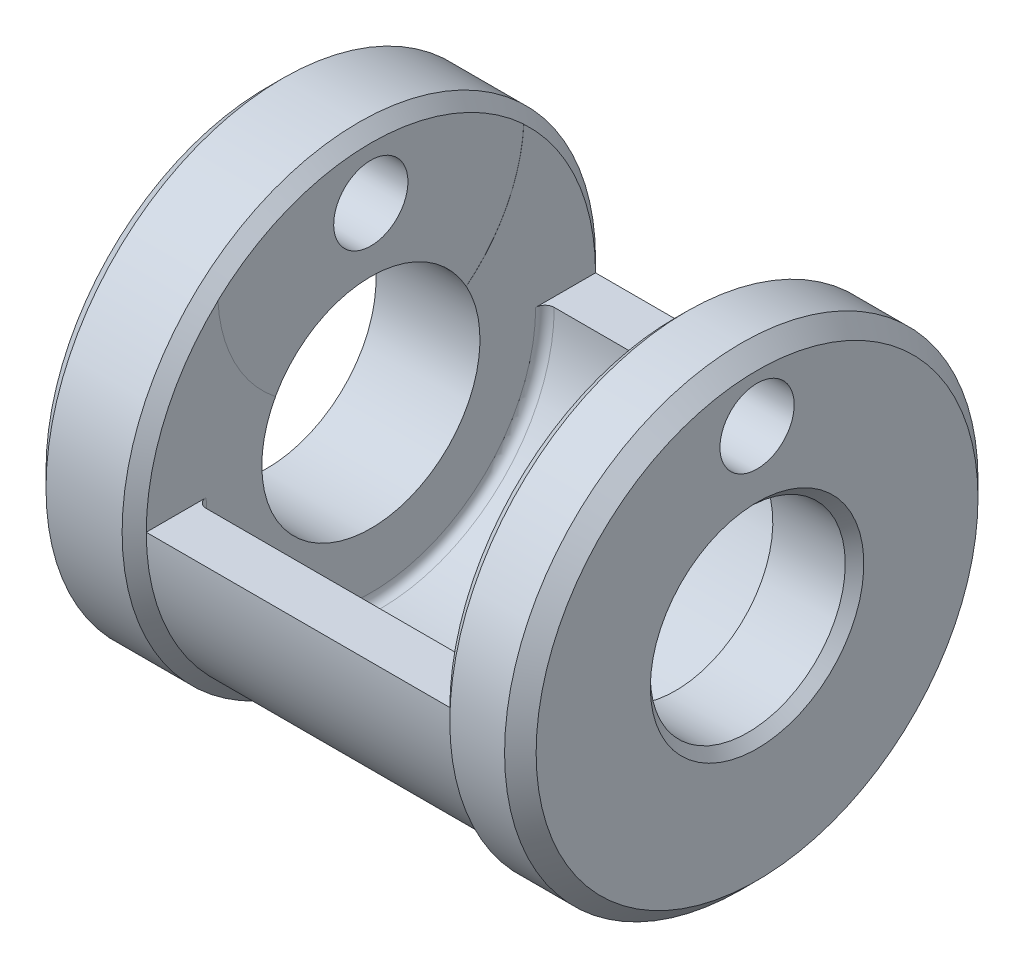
ISO-10303-21;
HEADER;
FILE_DESCRIPTION(('STEP AP214'),'2;1');
FILE_NAME('part.step','',(''),(''),'','','');
FILE_SCHEMA(('AUTOMOTIVE_DESIGN { 1 0 10303 214 1 1 1 1 }'));
ENDSEC;
DATA;
#1=APPLICATION_CONTEXT('core data for automotive mechanical design processes');
#2=APPLICATION_PROTOCOL_DEFINITION('international standard','automotive_design',2000,#1);
#3=PRODUCT_CONTEXT('',#1,'mechanical');
#4=PRODUCT('Part','Part','',(#3));
#5=PRODUCT_RELATED_PRODUCT_CATEGORY('part','',(#4));
#6=PRODUCT_DEFINITION_FORMATION('','',#4);
#7=PRODUCT_DEFINITION_CONTEXT('part definition',#1,'design');
#8=PRODUCT_DEFINITION('design','',#6,#7);
#9=PRODUCT_DEFINITION_SHAPE('','',#8);
#10=(LENGTH_UNIT() NAMED_UNIT(*) SI_UNIT(.MILLI.,.METRE.));
#11=(NAMED_UNIT(*) PLANE_ANGLE_UNIT() SI_UNIT($,.RADIAN.));
#12=(NAMED_UNIT(*) SI_UNIT($,.STERADIAN.) SOLID_ANGLE_UNIT());
#13=UNCERTAINTY_MEASURE_WITH_UNIT(LENGTH_MEASURE(1.E-05),#10,'distance_accuracy_value','');
#14=(GEOMETRIC_REPRESENTATION_CONTEXT(3) GLOBAL_UNCERTAINTY_ASSIGNED_CONTEXT((#13)) GLOBAL_UNIT_ASSIGNED_CONTEXT((#10,
#11,#12)) REPRESENTATION_CONTEXT('',''));
#15=CARTESIAN_POINT('',(0.,0.,0.));
#16=DIRECTION('',(0.,0.,1.));
#17=DIRECTION('',(1.,0.,0.));
#18=AXIS2_PLACEMENT_3D('',#15,#16,#17);
#19=CARTESIAN_POINT('',(-27.2,18.6,0.));
#20=DIRECTION('',(1.,0.,0.));
#21=DIRECTION('',(0.,0.,-1.));
#22=AXIS2_PLACEMENT_3D('',#19,#20,#21);
#23=CYLINDRICAL_SURFACE('',#22,4.);
#24=CARTESIAN_POINT('',(-25.,18.6,0.));
#25=DIRECTION('',(1.,0.,0.));
#26=DIRECTION('',(0.,0.,-1.));
#27=AXIS2_PLACEMENT_3D('',#24,#25,#26);
#28=CIRCLE('',#27,4.);
#29=CARTESIAN_POINT('',(-25.,18.6,-4.));
#30=VERTEX_POINT('',#29);
#31=EDGE_CURVE('E522',#30,#30,#28,.T.);
#32=ORIENTED_EDGE('',*,*,#31,.F.);
#33=EDGE_LOOP('',(#32));
#34=FACE_BOUND('',#33,.T.);
#35=CARTESIAN_POINT('',(-13.81,18.6,0.));
#36=DIRECTION('',(1.,0.,0.));
#37=DIRECTION('',(0.,1.,0.));
#38=AXIS2_PLACEMENT_3D('',#35,#36,#37);
#39=CIRCLE('',#38,4.);
#40=CARTESIAN_POINT('',(-13.81,22.6,0.));
#41=VERTEX_POINT('',#40);
#42=EDGE_CURVE('E680',#41,#41,#39,.F.);
#43=ORIENTED_EDGE('',*,*,#42,.F.);
#44=EDGE_LOOP('',(#43));
#45=FACE_BOUND('',#44,.T.);
#46=ADVANCED_FACE('F358',(#34,#45),#23,.F.);
#47=CARTESIAN_POINT('',(27.8,18.6000000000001,0.));
#48=DIRECTION('',(1.,0.,0.));
#49=DIRECTION('',(0.,0.,-1.));
#50=AXIS2_PLACEMENT_3D('',#47,#48,#49);
#51=CIRCLE('',#50,4.);
#52=CARTESIAN_POINT('',(27.8,18.6000000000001,-4.));
#53=VERTEX_POINT('',#52);
#54=EDGE_CURVE('E525',#53,#53,#51,.T.);
#55=ORIENTED_EDGE('',*,*,#54,.T.);
#56=EDGE_LOOP('',(#55));
#57=FACE_BOUND('',#56,.T.);
#58=CARTESIAN_POINT('',(19.01,18.6,0.));
#59=DIRECTION('',(-1.,0.,0.));
#60=DIRECTION('',(0.,0.,1.));
#61=AXIS2_PLACEMENT_3D('',#58,#59,#60);
#62=CIRCLE('',#61,4.);
#63=CARTESIAN_POINT('',(19.01,18.6,4.));
#64=VERTEX_POINT('',#63);
#65=EDGE_CURVE('E666',#64,#64,#62,.F.);
#66=ORIENTED_EDGE('',*,*,#65,.F.);
#67=EDGE_LOOP('',(#66));
#68=FACE_BOUND('',#67,.T.);
#69=ADVANCED_FACE('F579',(#57,#68),#23,.F.);
#70=CARTESIAN_POINT('',(-130.,0.,0.));
#71=DIRECTION('',(-1.,0.,0.));
#72=DIRECTION('',(0.,0.,1.));
#73=AXIS2_PLACEMENT_3D('',#70,#71,#72);
#74=CYLINDRICAL_SURFACE('',#73,10.5);
#75=CARTESIAN_POINT('',(26.8,0.,0.));
#76=DIRECTION('',(-1.,0.,0.));
#77=DIRECTION('',(0.,0.,1.));
#78=AXIS2_PLACEMENT_3D('',#75,#76,#77);
#79=CIRCLE('',#78,10.5);
#80=CARTESIAN_POINT('',(26.8,0.,10.5));
#81=VERTEX_POINT('',#80);
#82=EDGE_CURVE('E662',#81,#81,#79,.F.);
#83=ORIENTED_EDGE('',*,*,#82,.T.);
#84=EDGE_LOOP('',(#83));
#85=FACE_BOUND('',#84,.T.);
#86=CARTESIAN_POINT('',(19.01,0.,0.));
#87=DIRECTION('',(-1.,0.,0.));
#88=DIRECTION('',(0.,0.,1.));
#89=AXIS2_PLACEMENT_3D('',#86,#87,#88);
#90=CIRCLE('',#89,10.5);
#91=CARTESIAN_POINT('',(19.01,9.93003652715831,-3.41238546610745));
#92=VERTEX_POINT('',#91);
#93=CARTESIAN_POINT('',(19.01,9.93003652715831,3.41238546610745));
#94=VERTEX_POINT('',#93);
#95=EDGE_CURVE('E786',#92,#94,#90,.F.);
#96=ORIENTED_EDGE('',*,*,#95,.F.);
#97=DIRECTION('',(-1.,0.,0.));
#98=VECTOR('',#97,1.);
#99=CARTESIAN_POINT('',(19.005,9.9300365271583,-3.41238546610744));
#100=LINE('',#99,#98);
#101=CARTESIAN_POINT('',(19.,9.9300365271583,-3.41238546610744));
#102=VERTEX_POINT('',#101);
#103=EDGE_CURVE('E532',#92,#102,#100,.T.);
#104=ORIENTED_EDGE('',*,*,#103,.T.);
#105=CARTESIAN_POINT('',(19.,0.,0.));
#106=DIRECTION('',(1.,0.,0.));
#107=DIRECTION('',(0.,0.,-1.));
#108=AXIS2_PLACEMENT_3D('',#105,#106,#107);
#109=CIRCLE('',#108,10.5);
#110=CARTESIAN_POINT('',(19.,9.9300365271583,3.41238546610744));
#111=VERTEX_POINT('',#110);
#112=EDGE_CURVE('E501',#102,#111,#109,.F.);
#113=ORIENTED_EDGE('',*,*,#112,.T.);
#114=DIRECTION('',(-1.,0.,0.));
#115=VECTOR('',#114,1.);
#116=CARTESIAN_POINT('',(19.005,9.9300365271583,3.41238546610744));
#117=LINE('',#116,#115);
#118=EDGE_CURVE('E534',#111,#94,#117,.F.);
#119=ORIENTED_EDGE('',*,*,#118,.T.);
#120=EDGE_LOOP('',(#96,#104,#113,#119));
#121=FACE_BOUND('',#120,.T.);
#122=ADVANCED_FACE('F360',(#85,#121),#74,.F.);
#123=CARTESIAN_POINT('',(-13.8,0.,-27.5));
#124=DIRECTION('',(0.,-1.,0.));
#125=DIRECTION('',(0.,0.,-1.));
#126=AXIS2_PLACEMENT_3D('',#123,#124,#125);
#127=PLANE('',#126);
#128=DIRECTION('',(-1.,0.,0.));
#129=VECTOR('',#128,1.);
#130=CARTESIAN_POINT('',(-31.8084188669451,0.,18.75));
#131=LINE('',#130,#129);
#132=CARTESIAN_POINT('',(-12.8,0.,18.75));
#133=VERTEX_POINT('',#132);
#134=CARTESIAN_POINT('',(18.,0.,18.75));
#135=VERTEX_POINT('',#134);
#136=EDGE_CURVE('E517',#133,#135,#131,.F.);
#137=ORIENTED_EDGE('',*,*,#136,.F.);
#138=CARTESIAN_POINT('',(-12.8,0.,17.75));
#139=DIRECTION('',(0.,-1.,0.));
#140=DIRECTION('',(0.,0.,-1.));
#141=AXIS2_PLACEMENT_3D('',#138,#139,#140);
#142=CIRCLE('',#141,1.);
#143=CARTESIAN_POINT('',(-13.8,0.,17.75));
#144=VERTEX_POINT('',#143);
#145=EDGE_CURVE('E649',#133,#144,#142,.T.);
#146=ORIENTED_EDGE('',*,*,#145,.T.);
#147=DIRECTION('',(0.,0.,1.));
#148=VECTOR('',#147,1.);
#149=CARTESIAN_POINT('',(-13.8,0.,-27.5));
#150=LINE('',#149,#148);
#151=CARTESIAN_POINT('',(-13.8,0.,24.2000000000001));
#152=VERTEX_POINT('',#151);
#153=EDGE_CURVE('E514',#144,#152,#150,.T.);
#154=ORIENTED_EDGE('',*,*,#153,.T.);
#155=DIRECTION('',(-1.,0.,0.));
#156=VECTOR('',#155,1.);
#157=CARTESIAN_POINT('',(-130.,0.,24.2000000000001));
#158=LINE('',#157,#156);
#159=CARTESIAN_POINT('',(18.9,0.,24.2000000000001));
#160=VERTEX_POINT('',#159);
#161=EDGE_CURVE('E509',#160,#152,#158,.T.);
#162=ORIENTED_EDGE('',*,*,#161,.F.);
#163=DIRECTION('',(-0.707106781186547,0.,-0.707106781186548));
#164=VECTOR('',#163,1.);
#165=CARTESIAN_POINT('',(-5.29999999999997,0.,0.));
#166=LINE('',#165,#164);
#167=CARTESIAN_POINT('',(19.,0.,24.3));
#168=VERTEX_POINT('',#167);
#169=EDGE_CURVE('E626',#160,#168,#166,.F.);
#170=ORIENTED_EDGE('',*,*,#169,.T.);
#171=DIRECTION('',(0.,0.,1.));
#172=VECTOR('',#171,1.);
#173=CARTESIAN_POINT('',(19.,0.,-27.5));
#174=LINE('',#173,#172);
#175=CARTESIAN_POINT('',(19.,0.,17.75));
#176=VERTEX_POINT('',#175);
#177=EDGE_CURVE('E518',#176,#168,#174,.T.);
#178=ORIENTED_EDGE('',*,*,#177,.F.);
#179=CARTESIAN_POINT('',(18.,0.,17.75));
#180=DIRECTION('',(0.,-1.,0.));
#181=DIRECTION('',(0.,0.,-1.));
#182=AXIS2_PLACEMENT_3D('',#179,#180,#181);
#183=CIRCLE('',#182,1.);
#184=EDGE_CURVE('E654',#176,#135,#183,.T.);
#185=ORIENTED_EDGE('',*,*,#184,.T.);
#186=EDGE_LOOP('',(#137,#146,#154,#162,#170,#178,#185));
#187=FACE_BOUND('',#186,.T.);
#188=ADVANCED_FACE('F588',(#187),#127,.F.);
#189=DIRECTION('',(-1.,0.,0.));
#190=VECTOR('',#189,1.);
#191=CARTESIAN_POINT('',(-31.8084188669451,0.,-18.7499999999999));
#192=LINE('',#191,#190);
#193=CARTESIAN_POINT('',(18.,0.,-18.7499999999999));
#194=VERTEX_POINT('',#193);
#195=CARTESIAN_POINT('',(-12.8,0.,-18.7499999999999));
#196=VERTEX_POINT('',#195);
#197=EDGE_CURVE('E635',#194,#196,#192,.T.);
#198=ORIENTED_EDGE('',*,*,#197,.F.);
#199=CARTESIAN_POINT('',(18.,0.,-17.7499999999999));
#200=DIRECTION('',(0.,-1.,0.));
#201=DIRECTION('',(0.,0.,-1.));
#202=AXIS2_PLACEMENT_3D('',#199,#200,#201);
#203=CIRCLE('',#202,1.);
#204=CARTESIAN_POINT('',(19.,0.,-17.7499999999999));
#205=VERTEX_POINT('',#204);
#206=EDGE_CURVE('E656',#194,#205,#203,.T.);
#207=ORIENTED_EDGE('',*,*,#206,.T.);
#208=CARTESIAN_POINT('',(19.,0.,-24.2999999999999));
#209=VERTEX_POINT('',#208);
#210=EDGE_CURVE('E513',#209,#205,#174,.T.);
#211=ORIENTED_EDGE('',*,*,#210,.F.);
#212=DIRECTION('',(0.707106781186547,0.,-0.707106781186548));
#213=VECTOR('',#212,1.);
#214=CARTESIAN_POINT('',(-5.29999999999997,0.,0.));
#215=LINE('',#214,#213);
#216=CARTESIAN_POINT('',(18.9,0.,-24.1999999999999));
#217=VERTEX_POINT('',#216);
#218=EDGE_CURVE('E633',#209,#217,#215,.F.);
#219=ORIENTED_EDGE('',*,*,#218,.T.);
#220=DIRECTION('',(-1.,0.,0.));
#221=VECTOR('',#220,1.);
#222=CARTESIAN_POINT('',(-130.,0.,-24.1999999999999));
#223=LINE('',#222,#221);
#224=CARTESIAN_POINT('',(-13.8,0.,-24.1999999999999));
#225=VERTEX_POINT('',#224);
#226=EDGE_CURVE('E503',#225,#217,#223,.F.);
#227=ORIENTED_EDGE('',*,*,#226,.F.);
#228=CARTESIAN_POINT('',(-13.8,0.,-17.7499999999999));
#229=VERTEX_POINT('',#228);
#230=EDGE_CURVE('E516',#225,#229,#150,.T.);
#231=ORIENTED_EDGE('',*,*,#230,.T.);
#232=CARTESIAN_POINT('',(-12.8,0.,-17.7499999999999));
#233=DIRECTION('',(0.,-1.,0.));
#234=DIRECTION('',(0.,0.,-1.));
#235=AXIS2_PLACEMENT_3D('',#232,#233,#234);
#236=CIRCLE('',#235,1.);
#237=EDGE_CURVE('E652',#229,#196,#236,.T.);
#238=ORIENTED_EDGE('',*,*,#237,.T.);
#239=EDGE_LOOP('',(#198,#207,#211,#219,#227,#231,#238));
#240=FACE_BOUND('',#239,.T.);
#241=ADVANCED_FACE('F591',(#240),#127,.F.);
#242=CARTESIAN_POINT('',(27.8,25.5,0.));
#243=DIRECTION('',(-1.,0.,0.));
#244=DIRECTION('',(0.,0.,1.));
#245=AXIS2_PLACEMENT_3D('',#242,#243,#244);
#246=PLANE('',#245);
#247=CARTESIAN_POINT('',(27.8,0.,0.));
#248=DIRECTION('',(-1.,0.,0.));
#249=DIRECTION('',(0.,0.,1.));
#250=AXIS2_PLACEMENT_3D('',#247,#248,#249);
#251=CIRCLE('',#250,11.5);
#252=CARTESIAN_POINT('',(27.8,0.,11.5));
#253=VERTEX_POINT('',#252);
#254=EDGE_CURVE('E659',#253,#253,#251,.T.);
#255=ORIENTED_EDGE('',*,*,#254,.T.);
#256=EDGE_LOOP('',(#255));
#257=FACE_BOUND('',#256,.T.);
#258=ORIENTED_EDGE('',*,*,#54,.F.);
#259=EDGE_LOOP('',(#258));
#260=FACE_BOUND('',#259,.T.);
#261=CARTESIAN_POINT('',(27.8,0.,0.));
#262=DIRECTION('',(-1.,0.,0.));
#263=DIRECTION('',(0.,0.,1.));
#264=AXIS2_PLACEMENT_3D('',#261,#262,#263);
#265=CIRCLE('',#264,23.8);
#266=CARTESIAN_POINT('',(27.8,0.,23.8));
#267=VERTEX_POINT('',#266);
#268=EDGE_CURVE('E623',#267,#267,#265,.F.);
#269=ORIENTED_EDGE('',*,*,#268,.T.);
#270=EDGE_LOOP('',(#269));
#271=FACE_BOUND('',#270,.T.);
#272=ADVANCED_FACE('F751',(#257,#260,#271),#246,.F.);
#273=CARTESIAN_POINT('',(-130.,0.,0.));
#274=DIRECTION('',(-1.,0.,0.));
#275=DIRECTION('',(0.,0.,1.));
#276=AXIS2_PLACEMENT_3D('',#273,#274,#275);
#277=CYLINDRICAL_SURFACE('',#276,25.5);
#278=CARTESIAN_POINT('',(26.1,0.,0.));
#279=DIRECTION('',(-1.,0.,0.));
#280=DIRECTION('',(0.,0.,1.));
#281=AXIS2_PLACEMENT_3D('',#278,#279,#280);
#282=CIRCLE('',#281,25.5);
#283=CARTESIAN_POINT('',(26.1,0.,25.5));
#284=VERTEX_POINT('',#283);
#285=EDGE_CURVE('E615',#284,#284,#282,.T.);
#286=ORIENTED_EDGE('',*,*,#285,.T.);
#287=EDGE_LOOP('',(#286));
#288=FACE_BOUND('',#287,.T.);
#289=CARTESIAN_POINT('',(20.2,0.,0.));
#290=DIRECTION('',(1.,0.,0.));
#291=DIRECTION('',(0.,0.,-1.));
#292=AXIS2_PLACEMENT_3D('',#289,#290,#291);
#293=CIRCLE('',#292,25.5);
#294=CARTESIAN_POINT('',(20.2,0.,-25.5));
#295=VERTEX_POINT('',#294);
#296=EDGE_CURVE('E613',#295,#295,#293,.T.);
#297=ORIENTED_EDGE('',*,*,#296,.T.);
#298=EDGE_LOOP('',(#297));
#299=FACE_BOUND('',#298,.T.);
#300=ADVANCED_FACE('F754',(#288,#299),#277,.T.);
#301=CARTESIAN_POINT('',(-130.,0.,0.));
#302=DIRECTION('',(-1.,0.,0.));
#303=DIRECTION('',(0.,0.,1.));
#304=AXIS2_PLACEMENT_3D('',#301,#302,#303);
#305=CYLINDRICAL_SURFACE('',#304,24.2);
#306=CARTESIAN_POINT('',(18.9,0.,0.));
#307=DIRECTION('',(-1.,0.,0.));
#308=DIRECTION('',(0.,0.,1.));
#309=AXIS2_PLACEMENT_3D('',#306,#307,#308);
#310=CIRCLE('',#309,24.2);
#311=EDGE_CURVE('E494',#217,#160,#310,.T.);
#312=ORIENTED_EDGE('',*,*,#311,.T.);
#313=ORIENTED_EDGE('',*,*,#161,.T.);
#314=CARTESIAN_POINT('',(-13.8,0.,0.));
#315=DIRECTION('',(-1.,0.,0.));
#316=DIRECTION('',(0.,0.,1.));
#317=AXIS2_PLACEMENT_3D('',#314,#315,#316);
#318=CIRCLE('',#317,24.2);
#319=EDGE_CURVE('E493',#225,#152,#318,.T.);
#320=ORIENTED_EDGE('',*,*,#319,.F.);
#321=ORIENTED_EDGE('',*,*,#226,.T.);
#322=EDGE_LOOP('',(#312,#313,#320,#321));
#323=FACE_BOUND('',#322,.T.);
#324=ADVANCED_FACE('F772',(#323),#305,.T.);
#325=CARTESIAN_POINT('',(-130.,0.,0.));
#326=DIRECTION('',(-1.,0.,0.));
#327=DIRECTION('',(0.,0.,1.));
#328=AXIS2_PLACEMENT_3D('',#325,#326,#327);
#329=CYLINDRICAL_SURFACE('',#328,25.5);
#330=CARTESIAN_POINT('',(-23.3,0.,0.));
#331=DIRECTION('',(1.,0.,0.));
#332=DIRECTION('',(0.,0.,-1.));
#333=AXIS2_PLACEMENT_3D('',#330,#331,#332);
#334=CIRCLE('',#333,25.5);
#335=CARTESIAN_POINT('',(-23.3,0.,-25.5));
#336=VERTEX_POINT('',#335);
#337=EDGE_CURVE('E608',#336,#336,#334,.T.);
#338=ORIENTED_EDGE('',*,*,#337,.T.);
#339=EDGE_LOOP('',(#338));
#340=FACE_BOUND('',#339,.T.);
#341=CARTESIAN_POINT('',(-15.1,0.,0.));
#342=DIRECTION('',(-1.,0.,0.));
#343=DIRECTION('',(0.,0.,1.));
#344=AXIS2_PLACEMENT_3D('',#341,#342,#343);
#345=CIRCLE('',#344,25.5);
#346=CARTESIAN_POINT('',(-15.1,0.,25.5));
#347=VERTEX_POINT('',#346);
#348=EDGE_CURVE('E498',#347,#347,#345,.T.);
#349=ORIENTED_EDGE('',*,*,#348,.T.);
#350=EDGE_LOOP('',(#349));
#351=FACE_BOUND('',#350,.T.);
#352=ADVANCED_FACE('F792',(#340,#351),#329,.T.);
#353=CARTESIAN_POINT('',(-25.,10.5,0.));
#354=DIRECTION('',(1.,0.,0.));
#355=DIRECTION('',(0.,0.,-1.));
#356=AXIS2_PLACEMENT_3D('',#353,#354,#355);
#357=PLANE('',#356);
#358=CARTESIAN_POINT('',(-25.,0.,0.));
#359=DIRECTION('',(-1.,0.,0.));
#360=DIRECTION('',(0.,0.,1.));
#361=AXIS2_PLACEMENT_3D('',#358,#359,#360);
#362=CIRCLE('',#361,11.75);
#363=CARTESIAN_POINT('',(-25.,0.,11.75));
#364=VERTEX_POINT('',#363);
#365=EDGE_CURVE('E529',#364,#364,#362,.T.);
#366=ORIENTED_EDGE('',*,*,#365,.F.);
#367=EDGE_LOOP('',(#366));
#368=FACE_BOUND('',#367,.T.);
#369=ORIENTED_EDGE('',*,*,#31,.T.);
#370=EDGE_LOOP('',(#369));
#371=FACE_BOUND('',#370,.T.);
#372=CARTESIAN_POINT('',(-25.,0.,0.));
#373=DIRECTION('',(1.,0.,0.));
#374=DIRECTION('',(0.,0.,-1.));
#375=AXIS2_PLACEMENT_3D('',#372,#373,#374);
#376=CIRCLE('',#375,23.8);
#377=CARTESIAN_POINT('',(-25.,0.,-23.8));
#378=VERTEX_POINT('',#377);
#379=EDGE_CURVE('E611',#378,#378,#376,.F.);
#380=ORIENTED_EDGE('',*,*,#379,.T.);
#381=EDGE_LOOP('',(#380));
#382=FACE_BOUND('',#381,.T.);
#383=ADVANCED_FACE('F798',(#368,#371,#382),#357,.F.);
#384=CARTESIAN_POINT('',(-15.1,0.,0.));
#385=DIRECTION('',(-1.,0.,0.));
#386=DIRECTION('',(0.,0.,1.));
#387=AXIS2_PLACEMENT_3D('',#384,#385,#386);
#388=CONICAL_SURFACE('',#387,25.5,0.785398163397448);
#389=CARTESIAN_POINT('',(-13.7998,17.7242021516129,-16.4767405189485));
#390=CARTESIAN_POINT('',(-13.8015335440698,17.7264576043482,-16.4768604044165));
#391=CARTESIAN_POINT('',(-13.8032669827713,17.728713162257,-16.4769798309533));
#392=CARTESIAN_POINT('',(-13.806733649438,17.7332244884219,-16.4772177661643));
#393=CARTESIAN_POINT('',(-13.8084668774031,17.7354802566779,-16.4773362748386));
#394=CARTESIAN_POINT('',(-13.8102,17.7377361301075,-16.4774543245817));
#395=B_SPLINE_CURVE_WITH_KNOTS('',3,(#389,#390,#391,#392,#393,#394),.UNSPECIFIED.,.F.,.F.,(4,2,
4),(0.,0.00854163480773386,0.0170832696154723),.UNSPECIFIED.);
#396=CARTESIAN_POINT('',(-13.8,17.7244623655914,-16.4767543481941));
#397=VERTEX_POINT('',#396);
#398=CARTESIAN_POINT('',(-13.81,17.7374758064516,-16.4774406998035));
#399=VERTEX_POINT('',#398);
#400=EDGE_CURVE('E473',#397,#399,#395,.T.);
#401=ORIENTED_EDGE('',*,*,#400,.F.);
#402=EDGE_CURVE('E495',#397,#225,#318,.T.);
#403=ORIENTED_EDGE('',*,*,#402,.T.);
#404=ORIENTED_EDGE('',*,*,#319,.T.);
#405=CARTESIAN_POINT('',(-13.8,17.7244623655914,16.4767543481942));
#406=VERTEX_POINT('',#405);
#407=EDGE_CURVE('E480',#152,#406,#318,.T.);
#408=ORIENTED_EDGE('',*,*,#407,.T.);
#409=CARTESIAN_POINT('',(-13.8102,17.7377361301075,16.4774543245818));
#410=CARTESIAN_POINT('',(-13.8084668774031,17.7354802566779,16.4773362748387));
#411=CARTESIAN_POINT('',(-13.806733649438,17.7332244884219,16.4772177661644));
#412=CARTESIAN_POINT('',(-13.8032669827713,17.728713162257,16.4769798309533));
#413=CARTESIAN_POINT('',(-13.8015335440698,17.7264576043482,16.4768604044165));
#414=CARTESIAN_POINT('',(-13.7998,17.7242021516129,16.4767405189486));
#415=B_SPLINE_CURVE_WITH_KNOTS('',3,(#409,#410,#411,#412,#413,#414),.UNSPECIFIED.,.F.,.F.,(4,2,
4),(0.,0.00854163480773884,0.0170832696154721),.UNSPECIFIED.);
#416=CARTESIAN_POINT('',(-13.81,17.7374758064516,16.4774406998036));
#417=VERTEX_POINT('',#416);
#418=EDGE_CURVE('E465',#417,#406,#415,.T.);
#419=ORIENTED_EDGE('',*,*,#418,.F.);
#420=CARTESIAN_POINT('',(-13.81,0.,0.));
#421=DIRECTION('',(1.,0.,0.));
#422=DIRECTION('',(0.,1.,0.));
#423=AXIS2_PLACEMENT_3D('',#420,#421,#422);
#424=CIRCLE('',#423,24.21);
#425=EDGE_CURVE('E474',#417,#399,#424,.F.);
#426=ORIENTED_EDGE('',*,*,#425,.T.);
#427=EDGE_LOOP('',(#401,#403,#404,#408,#419,#426));
#428=FACE_BOUND('',#427,.T.);
#429=ORIENTED_EDGE('',*,*,#348,.F.);
#430=EDGE_LOOP('',(#429));
#431=FACE_BOUND('',#430,.T.);
#432=ADVANCED_FACE('F490',(#428,#431),#388,.T.);
#433=CARTESIAN_POINT('',(18.9,0.,0.));
#434=DIRECTION('',(1.,0.,0.));
#435=DIRECTION('',(0.,0.,-1.));
#436=AXIS2_PLACEMENT_3D('',#433,#434,#435);
#437=CONICAL_SURFACE('',#436,24.2,0.785398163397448);
#438=CARTESIAN_POINT('',(19.0102,22.8530425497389,-8.2900102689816));
#439=CARTESIAN_POINT('',(19.0084674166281,22.8507780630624,-8.29117202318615));
#440=CARTESIAN_POINT('',(19.0067344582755,22.8485133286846,-8.29233273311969));
#441=CARTESIAN_POINT('',(19.0032677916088,22.8439833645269,-8.29465206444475));
#442=CARTESIAN_POINT('',(19.0015340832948,22.8417181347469,-8.29581068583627));
#443=CARTESIAN_POINT('',(18.9998,22.8394526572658,-8.29696826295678));
#444=B_SPLINE_CURVE_WITH_KNOTS('',3,(#438,#439,#440,#441,#442,#443),.UNSPECIFIED.,.F.,.F.,(4,2,
4),(0.,0.00923659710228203,0.0184731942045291),.UNSPECIFIED.);
#445=CARTESIAN_POINT('',(19.01,22.8527811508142,-8.29014436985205));
#446=VERTEX_POINT('',#445);
#447=CARTESIAN_POINT('',(19.,22.8397139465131,-8.29683474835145));
#448=VERTEX_POINT('',#447);
#449=EDGE_CURVE('E381',#446,#448,#444,.T.);
#450=ORIENTED_EDGE('',*,*,#449,.F.);
#451=CARTESIAN_POINT('',(19.01,0.,0.));
#452=DIRECTION('',(-1.,0.,0.));
#453=DIRECTION('',(0.,0.,1.));
#454=AXIS2_PLACEMENT_3D('',#451,#452,#453);
#455=CIRCLE('',#454,24.31);
#456=CARTESIAN_POINT('',(19.01,22.8527811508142,8.29014436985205));
#457=VERTEX_POINT('',#456);
#458=EDGE_CURVE('E669',#446,#457,#455,.F.);
#459=ORIENTED_EDGE('',*,*,#458,.T.);
#460=CARTESIAN_POINT('',(18.9998,22.8394526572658,8.29696826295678));
#461=CARTESIAN_POINT('',(19.0015340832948,22.8417181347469,8.29581068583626));
#462=CARTESIAN_POINT('',(19.0032677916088,22.8439833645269,8.29465206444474));
#463=CARTESIAN_POINT('',(19.0067344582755,22.8485133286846,8.29233273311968));
#464=CARTESIAN_POINT('',(19.0084674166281,22.8507780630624,8.29117202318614));
#465=CARTESIAN_POINT('',(19.0102,22.8530425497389,8.2900102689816));
#466=B_SPLINE_CURVE_WITH_KNOTS('',3,(#460,#461,#462,#463,#464,#465),.UNSPECIFIED.,.F.,.F.,(4,2,
4),(0.,0.00923659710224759,0.0184731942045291),.UNSPECIFIED.);
#467=CARTESIAN_POINT('',(19.,22.8397139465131,8.29683474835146));
#468=VERTEX_POINT('',#467);
#469=EDGE_CURVE('E542',#468,#457,#466,.T.);
#470=ORIENTED_EDGE('',*,*,#469,.F.);
#471=CARTESIAN_POINT('',(19.,0.,0.));
#472=DIRECTION('',(1.,0.,0.));
#473=DIRECTION('',(0.,0.,-1.));
#474=AXIS2_PLACEMENT_3D('',#471,#472,#473);
#475=CIRCLE('',#474,24.3);
#476=EDGE_CURVE('E630',#168,#468,#475,.F.);
#477=ORIENTED_EDGE('',*,*,#476,.F.);
#478=ORIENTED_EDGE('',*,*,#169,.F.);
#479=ORIENTED_EDGE('',*,*,#311,.F.);
#480=ORIENTED_EDGE('',*,*,#218,.F.);
#481=EDGE_CURVE('E629',#448,#209,#475,.F.);
#482=ORIENTED_EDGE('',*,*,#481,.F.);
#483=EDGE_LOOP('',(#450,#459,#470,#477,#478,#479,#480,#482));
#484=FACE_BOUND('',#483,.T.);
#485=ORIENTED_EDGE('',*,*,#296,.F.);
#486=EDGE_LOOP('',(#485));
#487=FACE_BOUND('',#486,.T.);
#488=ADVANCED_FACE('F547',(#484,#487),#437,.T.);
#489=CARTESIAN_POINT('',(-25.,0.,0.));
#490=DIRECTION('',(1.,0.,0.));
#491=DIRECTION('',(0.,0.,-1.));
#492=AXIS2_PLACEMENT_3D('',#489,#490,#491);
#493=CONICAL_SURFACE('',#492,23.8,0.785398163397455);
#494=CARTESIAN_POINT('',(-23.3,0.,-25.5));
#495=CARTESIAN_POINT('',(-23.3177083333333,0.,-25.4822916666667));
#496=CARTESIAN_POINT('',(-23.3354166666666,0.,-25.4645833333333));
#497=CARTESIAN_POINT('',(-23.3708333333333,0.,-25.4291666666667));
#498=CARTESIAN_POINT('',(-23.3885416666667,0.,-25.4114583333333));
#499=CARTESIAN_POINT('',(-23.4239583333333,0.,-25.3760416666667));
#500=CARTESIAN_POINT('',(-23.4416666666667,0.,-25.3583333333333));
#501=CARTESIAN_POINT('',(-23.4770833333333,0.,-25.3229166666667));
#502=CARTESIAN_POINT('',(-23.4947916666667,0.,-25.3052083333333));
#503=CARTESIAN_POINT('',(-23.5302083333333,0.,-25.2697916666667));
#504=CARTESIAN_POINT('',(-23.5479166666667,0.,-25.2520833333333));
#505=CARTESIAN_POINT('',(-23.5833333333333,0.,-25.2166666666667));
#506=CARTESIAN_POINT('',(-23.6010416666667,0.,-25.1989583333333));
#507=CARTESIAN_POINT('',(-23.6364583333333,0.,-25.1635416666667));
#508=CARTESIAN_POINT('',(-23.6541666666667,0.,-25.1458333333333));
#509=CARTESIAN_POINT('',(-23.6895833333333,0.,-25.1104166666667));
#510=CARTESIAN_POINT('',(-23.7072916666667,0.,-25.0927083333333));
#511=CARTESIAN_POINT('',(-23.7427083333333,0.,-25.0572916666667));
#512=CARTESIAN_POINT('',(-23.7604166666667,0.,-25.0395833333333));
#513=CARTESIAN_POINT('',(-23.7958333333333,0.,-25.0041666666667));
#514=CARTESIAN_POINT('',(-23.8135416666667,0.,-24.9864583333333));
#515=CARTESIAN_POINT('',(-23.8489583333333,0.,-24.9510416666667));
#516=CARTESIAN_POINT('',(-23.8666666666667,0.,-24.9333333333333));
#517=CARTESIAN_POINT('',(-23.9020833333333,0.,-24.8979166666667));
#518=CARTESIAN_POINT('',(-23.9197916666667,0.,-24.8802083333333));
#519=CARTESIAN_POINT('',(-23.9552083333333,0.,-24.8447916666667));
#520=CARTESIAN_POINT('',(-23.9729166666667,0.,-24.8270833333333));
#521=CARTESIAN_POINT('',(-24.0083333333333,0.,-24.7916666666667));
#522=CARTESIAN_POINT('',(-24.0260416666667,0.,-24.7739583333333));
#523=CARTESIAN_POINT('',(-24.0614583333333,0.,-24.7385416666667));
#524=CARTESIAN_POINT('',(-24.0791666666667,0.,-24.7208333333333));
#525=CARTESIAN_POINT('',(-24.1145833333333,0.,-24.6854166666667));
#526=CARTESIAN_POINT('',(-24.1322916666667,0.,-24.6677083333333));
#527=CARTESIAN_POINT('',(-24.1677083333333,0.,-24.6322916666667));
#528=CARTESIAN_POINT('',(-24.1854166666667,0.,-24.6145833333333));
#529=CARTESIAN_POINT('',(-24.2208333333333,0.,-24.5791666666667));
#530=CARTESIAN_POINT('',(-24.2385416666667,0.,-24.5614583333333));
#531=CARTESIAN_POINT('',(-24.2739583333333,0.,-24.5260416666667));
#532=CARTESIAN_POINT('',(-24.2916666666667,0.,-24.5083333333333));
#533=CARTESIAN_POINT('',(-24.3270833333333,0.,-24.4729166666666));
#534=CARTESIAN_POINT('',(-24.3447916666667,0.,-24.4552083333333));
#535=CARTESIAN_POINT('',(-24.3802083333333,0.,-24.4197916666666));
#536=CARTESIAN_POINT('',(-24.3979166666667,0.,-24.4020833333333));
#537=CARTESIAN_POINT('',(-24.4333333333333,0.,-24.3666666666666));
#538=CARTESIAN_POINT('',(-24.4510416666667,0.,-24.3489583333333));
#539=CARTESIAN_POINT('',(-24.4864583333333,0.,-24.3135416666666));
#540=CARTESIAN_POINT('',(-24.5041666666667,0.,-24.2958333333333));
#541=CARTESIAN_POINT('',(-24.5395833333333,0.,-24.2604166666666));
#542=CARTESIAN_POINT('',(-24.5572916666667,0.,-24.2427083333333));
#543=CARTESIAN_POINT('',(-24.5927083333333,0.,-24.2072916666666));
#544=CARTESIAN_POINT('',(-24.6104166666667,0.,-24.1895833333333));
#545=CARTESIAN_POINT('',(-24.6458333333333,0.,-24.1541666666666));
#546=CARTESIAN_POINT('',(-24.6635416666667,0.,-24.1364583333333));
#547=CARTESIAN_POINT('',(-24.6989583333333,0.,-24.1010416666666));
#548=CARTESIAN_POINT('',(-24.7166666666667,0.,-24.0833333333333));
#549=CARTESIAN_POINT('',(-24.7520833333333,0.,-24.0479166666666));
#550=CARTESIAN_POINT('',(-24.7697916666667,0.,-24.0302083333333));
#551=CARTESIAN_POINT('',(-24.8052083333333,0.,-23.9947916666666));
#552=CARTESIAN_POINT('',(-24.8229166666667,0.,-23.9770833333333));
#553=CARTESIAN_POINT('',(-24.8583333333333,0.,-23.9416666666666));
#554=CARTESIAN_POINT('',(-24.8760416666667,0.,-23.9239583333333));
#555=CARTESIAN_POINT('',(-24.9114583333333,0.,-23.8885416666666));
#556=CARTESIAN_POINT('',(-24.9291666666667,0.,-23.8708333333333));
#557=CARTESIAN_POINT('',(-24.9645833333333,0.,-23.8354166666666));
#558=CARTESIAN_POINT('',(-24.9822916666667,0.,-23.8177083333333));
#559=CARTESIAN_POINT('',(-25.,0.,-23.8));
#560=B_SPLINE_CURVE_WITH_KNOTS('',3,(#494,#495,#496,#497,#498,#499,#500,#501,#502,#503,#504,
#505,#506,#507,#508,#509,#510,#511,#512,#513,#514,#515,#516,#517,#518,#519,#520,#521,#522,#523,
#524,#525,#526,#527,#528,#529,#530,#531,#532,#533,#534,#535,#536,#537,#538,#539,#540,#541,#542,
#543,#544,#545,#546,#547,#548,#549,#550,#551,#552,#553,#554,#555,#556,#557,#558,#559),
.UNSPECIFIED.,.F.,.F.,(4,2,2,2,2,2,2,2,2,2,2,2,2,2,2,2,2,2,2,2,2,2,2,2,2,2,2,2,2,2,2,2,4),(0.,
0.0751300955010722,0.150260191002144,0.225390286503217,0.300520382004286,0.375650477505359,
0.450780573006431,0.525910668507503,0.601040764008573,0.676170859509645,0.751300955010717,
0.826431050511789,0.901561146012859,0.976691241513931,1.051821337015,1.12695143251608,
1.20208152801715,1.27721162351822,1.35234171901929,1.42747181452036,1.50260191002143,
1.5777320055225,1.65286210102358,1.72799219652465,1.80312229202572,1.87825238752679,
1.95338248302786,2.02851257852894,2.10364267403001,2.17877276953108,2.25390286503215,
2.32903296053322,2.40416305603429),.UNSPECIFIED.);
#561=EDGE_CURVE('BSEAM597',#336,#378,#560,.T.);
#562=ORIENTED_EDGE('',*,*,#337,.F.);
#563=ORIENTED_EDGE('',*,*,#379,.F.);
#564=ORIENTED_EDGE('',*,*,#561,.T.);
#565=ORIENTED_EDGE('',*,*,#561,.F.);
#566=EDGE_LOOP('',(#562,#564,#563,#565));
#567=FACE_BOUND('',#566,.T.);
#568=ADVANCED_FACE('F597',(#567),#493,.T.);
#569=CARTESIAN_POINT('',(26.1,0.,0.));
#570=DIRECTION('',(-1.,0.,0.));
#571=DIRECTION('',(0.,0.,1.));
#572=AXIS2_PLACEMENT_3D('',#569,#570,#571);
#573=CONICAL_SURFACE('',#572,25.5,0.785398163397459);
#574=ORIENTED_EDGE('',*,*,#268,.F.);
#575=EDGE_LOOP('',(#574));
#576=FACE_BOUND('',#575,.T.);
#577=ORIENTED_EDGE('',*,*,#285,.F.);
#578=EDGE_LOOP('',(#577));
#579=FACE_BOUND('',#578,.T.);
#580=ADVANCED_FACE('F595',(#576,#579),#573,.T.);
#581=CARTESIAN_POINT('',(-13.8,28.0994313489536,-27.5));
#582=DIRECTION('',(-1.,0.,0.));
#583=DIRECTION('',(0.,-1.,0.));
#584=AXIS2_PLACEMENT_3D('',#581,#582,#583);
#585=PLANE('',#584);
#586=CARTESIAN_POINT('',(-13.8,0.,0.));
#587=DIRECTION('',(-1.,0.,0.));
#588=DIRECTION('',(0.,-1.,0.));
#589=AXIS2_PLACEMENT_3D('',#586,#587,#588);
#590=CIRCLE('',#589,11.75);
#591=CARTESIAN_POINT('',(-13.8,5.69280913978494,10.2788337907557));
#592=VERTEX_POINT('',#591);
#593=CARTESIAN_POINT('',(-13.8,5.69280913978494,-10.2788337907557));
#594=VERTEX_POINT('',#593);
#595=EDGE_CURVE('E484',#592,#594,#590,.F.);
#596=ORIENTED_EDGE('',*,*,#595,.F.);
#597=CARTESIAN_POINT('',(-13.8,18.6,0.));
#598=DIRECTION('',(1.,0.,0.));
#599=DIRECTION('',(0.,1.,0.));
#600=AXIS2_PLACEMENT_3D('',#597,#598,#599);
#601=CIRCLE('',#600,16.5);
#602=EDGE_CURVE('E468',#406,#592,#601,.T.);
#603=ORIENTED_EDGE('',*,*,#602,.F.);
#604=ORIENTED_EDGE('',*,*,#407,.F.);
#605=ORIENTED_EDGE('',*,*,#153,.F.);
#606=CARTESIAN_POINT('',(-13.8,0.,0.));
#607=DIRECTION('',(-1.,0.,0.));
#608=DIRECTION('',(0.,-1.,0.));
#609=AXIS2_PLACEMENT_3D('',#606,#607,#608);
#610=CIRCLE('',#609,17.75);
#611=EDGE_CURVE('E643',#144,#229,#610,.F.);
#612=ORIENTED_EDGE('',*,*,#611,.T.);
#613=ORIENTED_EDGE('',*,*,#230,.F.);
#614=ORIENTED_EDGE('',*,*,#402,.F.);
#615=EDGE_CURVE('E486',#594,#397,#601,.T.);
#616=ORIENTED_EDGE('',*,*,#615,.F.);
#617=EDGE_LOOP('',(#596,#603,#604,#605,#612,#613,#614,#616));
#618=FACE_BOUND('',#617,.T.);
#619=ADVANCED_FACE('F479',(#618),#585,.F.);
#620=CARTESIAN_POINT('',(19.,28.0994313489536,-27.5));
#621=DIRECTION('',(1.,0.,0.));
#622=DIRECTION('',(0.,0.,-1.));
#623=AXIS2_PLACEMENT_3D('',#620,#621,#622);
#624=PLANE('',#623);
#625=ORIENTED_EDGE('',*,*,#476,.T.);
#626=CARTESIAN_POINT('',(19.,18.6,0.));
#627=DIRECTION('',(-1.,0.,0.));
#628=DIRECTION('',(0.,0.,1.));
#629=AXIS2_PLACEMENT_3D('',#626,#627,#628);
#630=CIRCLE('',#629,9.31733015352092);
#631=EDGE_CURVE('E780',#111,#468,#630,.T.);
#632=ORIENTED_EDGE('',*,*,#631,.F.);
#633=ORIENTED_EDGE('',*,*,#112,.F.);
#634=EDGE_CURVE('E781',#448,#102,#630,.T.);
#635=ORIENTED_EDGE('',*,*,#634,.F.);
#636=ORIENTED_EDGE('',*,*,#481,.T.);
#637=ORIENTED_EDGE('',*,*,#210,.T.);
#638=CARTESIAN_POINT('',(19.,0.,0.));
#639=DIRECTION('',(1.,0.,0.));
#640=DIRECTION('',(0.,0.,-1.));
#641=AXIS2_PLACEMENT_3D('',#638,#639,#640);
#642=CIRCLE('',#641,17.75);
#643=EDGE_CURVE('E646',#205,#176,#642,.F.);
#644=ORIENTED_EDGE('',*,*,#643,.T.);
#645=ORIENTED_EDGE('',*,*,#177,.T.);
#646=EDGE_LOOP('',(#625,#632,#633,#635,#636,#637,#644,#645));
#647=FACE_BOUND('',#646,.T.);
#648=ADVANCED_FACE('F583',(#647),#624,.F.);
#649=CARTESIAN_POINT('',(-31.8084188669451,0.,0.));
#650=DIRECTION('',(-1.,0.,0.));
#651=DIRECTION('',(0.,0.,1.));
#652=AXIS2_PLACEMENT_3D('',#649,#650,#651);
#653=CYLINDRICAL_SURFACE('',#652,18.75);
#654=ORIENTED_EDGE('',*,*,#197,.T.);
#655=CARTESIAN_POINT('',(-12.8,0.,0.));
#656=DIRECTION('',(-1.,0.,0.));
#657=DIRECTION('',(0.,-1.,0.));
#658=AXIS2_PLACEMENT_3D('',#655,#656,#657);
#659=CIRCLE('',#658,18.75);
#660=EDGE_CURVE('E640',#196,#133,#659,.T.);
#661=ORIENTED_EDGE('',*,*,#660,.T.);
#662=ORIENTED_EDGE('',*,*,#136,.T.);
#663=CARTESIAN_POINT('',(18.,0.,0.));
#664=DIRECTION('',(1.,0.,0.));
#665=DIRECTION('',(0.,0.,-1.));
#666=AXIS2_PLACEMENT_3D('',#663,#664,#665);
#667=CIRCLE('',#666,18.75);
#668=EDGE_CURVE('E638',#135,#194,#667,.T.);
#669=ORIENTED_EDGE('',*,*,#668,.T.);
#670=EDGE_LOOP('',(#654,#661,#662,#669));
#671=FACE_BOUND('',#670,.T.);
#672=ADVANCED_FACE('F575',(#671),#653,.F.);
#673=CARTESIAN_POINT('',(-12.8,0.,0.));
#674=DIRECTION('',(-1.,0.,0.));
#675=DIRECTION('',(0.,-1.,0.));
#676=AXIS2_PLACEMENT_3D('',#673,#674,#675);
#677=TOROIDAL_SURFACE('',#676,17.75,1.);
#678=ORIENTED_EDGE('',*,*,#237,.F.);
#679=ORIENTED_EDGE('',*,*,#611,.F.);
#680=ORIENTED_EDGE('',*,*,#145,.F.);
#681=ORIENTED_EDGE('',*,*,#660,.F.);
#682=EDGE_LOOP('',(#678,#679,#680,#681));
#683=FACE_BOUND('',#682,.T.);
#684=ADVANCED_FACE('F571',(#683),#677,.F.);
#685=CARTESIAN_POINT('',(18.,0.,0.));
#686=DIRECTION('',(1.,0.,0.));
#687=DIRECTION('',(0.,0.,-1.));
#688=AXIS2_PLACEMENT_3D('',#685,#686,#687);
#689=TOROIDAL_SURFACE('',#688,17.75,1.);
#690=ORIENTED_EDGE('',*,*,#206,.F.);
#691=ORIENTED_EDGE('',*,*,#668,.F.);
#692=ORIENTED_EDGE('',*,*,#184,.F.);
#693=ORIENTED_EDGE('',*,*,#643,.F.);
#694=EDGE_LOOP('',(#690,#691,#692,#693));
#695=FACE_BOUND('',#694,.T.);
#696=ADVANCED_FACE('F567',(#695),#689,.F.);
#697=CARTESIAN_POINT('',(27.801,0.,0.));
#698=DIRECTION('',(-1.,0.,0.));
#699=DIRECTION('',(0.,0.,1.));
#700=AXIS2_PLACEMENT_3D('',#697,#698,#699);
#701=CYLINDRICAL_SURFACE('',#700,11.75);
#702=ORIENTED_EDGE('',*,*,#595,.T.);
#703=DIRECTION('',(1.,0.,0.));
#704=VECTOR('',#703,1.);
#705=CARTESIAN_POINT('',(-13.805,5.69280913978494,-10.2788337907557));
#706=LINE('',#705,#704);
#707=CARTESIAN_POINT('',(-13.81,5.69280913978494,-10.2788337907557));
#708=VERTEX_POINT('',#707);
#709=EDGE_CURVE('E13',#594,#708,#706,.F.);
#710=ORIENTED_EDGE('',*,*,#709,.T.);
#711=CARTESIAN_POINT('',(-13.81,0.,0.));
#712=DIRECTION('',(1.,0.,0.));
#713=DIRECTION('',(0.,1.,0.));
#714=AXIS2_PLACEMENT_3D('',#711,#712,#713);
#715=CIRCLE('',#714,11.75);
#716=CARTESIAN_POINT('',(-13.81,5.69280913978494,10.2788337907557));
#717=VERTEX_POINT('',#716);
#718=EDGE_CURVE('E665',#717,#708,#715,.F.);
#719=ORIENTED_EDGE('',*,*,#718,.F.);
#720=DIRECTION('',(1.,0.,0.));
#721=VECTOR('',#720,1.);
#722=CARTESIAN_POINT('',(-13.805,5.69280913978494,10.2788337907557));
#723=LINE('',#722,#721);
#724=EDGE_CURVE('E366',#717,#592,#723,.T.);
#725=ORIENTED_EDGE('',*,*,#724,.T.);
#726=EDGE_LOOP('',(#702,#710,#719,#725));
#727=FACE_BOUND('',#726,.T.);
#728=ORIENTED_EDGE('',*,*,#365,.T.);
#729=EDGE_LOOP('',(#728));
#730=FACE_BOUND('',#729,.T.);
#731=ADVANCED_FACE('F563',(#727,#730),#701,.F.);
#732=CARTESIAN_POINT('',(27.8,0.,0.));
#733=DIRECTION('',(1.,0.,0.));
#734=DIRECTION('',(0.,0.,-1.));
#735=AXIS2_PLACEMENT_3D('',#732,#733,#734);
#736=CONICAL_SURFACE('',#735,11.5,0.785398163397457);
#737=ORIENTED_EDGE('',*,*,#82,.F.);
#738=EDGE_LOOP('',(#737));
#739=FACE_BOUND('',#738,.T.);
#740=ORIENTED_EDGE('',*,*,#254,.F.);
#741=EDGE_LOOP('',(#740));
#742=FACE_BOUND('',#741,.T.);
#743=ADVANCED_FACE('F557',(#739,#742),#736,.F.);
#744=CARTESIAN_POINT('',(19.01,18.6,0.));
#745=DIRECTION('',(-1.,0.,0.));
#746=DIRECTION('',(0.,0.,1.));
#747=AXIS2_PLACEMENT_3D('',#744,#745,#746);
#748=CYLINDRICAL_SURFACE('',#747,9.31733015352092);
#749=CARTESIAN_POINT('',(19.01,18.6,0.));
#750=DIRECTION('',(-1.,0.,0.));
#751=DIRECTION('',(0.,0.,1.));
#752=AXIS2_PLACEMENT_3D('',#749,#750,#751);
#753=CIRCLE('',#752,9.31733015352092);
#754=EDGE_CURVE('E670',#446,#92,#753,.T.);
#755=ORIENTED_EDGE('',*,*,#754,.F.);
#756=ORIENTED_EDGE('',*,*,#449,.T.);
#757=ORIENTED_EDGE('',*,*,#634,.T.);
#758=ORIENTED_EDGE('',*,*,#103,.F.);
#759=EDGE_LOOP('',(#755,#756,#757,#758));
#760=FACE_BOUND('',#759,.T.);
#761=ADVANCED_FACE('F551',(#760),#748,.F.);
#762=ORIENTED_EDGE('',*,*,#631,.T.);
#763=ORIENTED_EDGE('',*,*,#469,.T.);
#764=EDGE_CURVE('E782',#94,#457,#753,.T.);
#765=ORIENTED_EDGE('',*,*,#764,.F.);
#766=ORIENTED_EDGE('',*,*,#118,.F.);
#767=EDGE_LOOP('',(#762,#763,#765,#766));
#768=FACE_BOUND('',#767,.T.);
#769=ADVANCED_FACE('F556',(#768),#748,.F.);
#770=CARTESIAN_POINT('',(19.01,18.6,0.));
#771=DIRECTION('',(-1.,0.,0.));
#772=DIRECTION('',(0.,0.,1.));
#773=AXIS2_PLACEMENT_3D('',#770,#771,#772);
#774=PLANE('',#773);
#775=ORIENTED_EDGE('',*,*,#65,.T.);
#776=EDGE_LOOP('',(#775));
#777=FACE_BOUND('',#776,.T.);
#778=ORIENTED_EDGE('',*,*,#95,.T.);
#779=ORIENTED_EDGE('',*,*,#764,.T.);
#780=ORIENTED_EDGE('',*,*,#458,.F.);
#781=ORIENTED_EDGE('',*,*,#754,.T.);
#782=EDGE_LOOP('',(#778,#779,#780,#781));
#783=FACE_BOUND('',#782,.T.);
#784=ADVANCED_FACE('F558',(#777,#783),#774,.T.);
#785=CARTESIAN_POINT('',(-13.81,18.6,0.));
#786=DIRECTION('',(1.,0.,0.));
#787=DIRECTION('',(0.,1.,0.));
#788=AXIS2_PLACEMENT_3D('',#785,#786,#787);
#789=CYLINDRICAL_SURFACE('',#788,16.5);
#790=ORIENTED_EDGE('',*,*,#400,.T.);
#791=CARTESIAN_POINT('',(-13.81,18.6,0.));
#792=DIRECTION('',(1.,0.,0.));
#793=DIRECTION('',(0.,1.,0.));
#794=AXIS2_PLACEMENT_3D('',#791,#792,#793);
#795=CIRCLE('',#794,16.5);
#796=EDGE_CURVE('E485',#708,#399,#795,.T.);
#797=ORIENTED_EDGE('',*,*,#796,.F.);
#798=ORIENTED_EDGE('',*,*,#709,.F.);
#799=ORIENTED_EDGE('',*,*,#615,.T.);
#800=EDGE_LOOP('',(#790,#797,#798,#799));
#801=FACE_BOUND('',#800,.T.);
#802=ADVANCED_FACE('F678',(#801),#789,.F.);
#803=ORIENTED_EDGE('',*,*,#418,.T.);
#804=ORIENTED_EDGE('',*,*,#602,.T.);
#805=ORIENTED_EDGE('',*,*,#724,.F.);
#806=EDGE_CURVE('E373',#417,#717,#795,.T.);
#807=ORIENTED_EDGE('',*,*,#806,.F.);
#808=EDGE_LOOP('',(#803,#804,#805,#807));
#809=FACE_BOUND('',#808,.T.);
#810=ADVANCED_FACE('F467',(#809),#789,.F.);
#811=CARTESIAN_POINT('',(-13.81,18.6,0.));
#812=DIRECTION('',(1.,0.,0.));
#813=DIRECTION('',(0.,1.,0.));
#814=AXIS2_PLACEMENT_3D('',#811,#812,#813);
#815=PLANE('',#814);
#816=ORIENTED_EDGE('',*,*,#806,.T.);
#817=ORIENTED_EDGE('',*,*,#718,.T.);
#818=ORIENTED_EDGE('',*,*,#796,.T.);
#819=ORIENTED_EDGE('',*,*,#425,.F.);
#820=EDGE_LOOP('',(#816,#817,#818,#819));
#821=FACE_BOUND('',#820,.T.);
#822=ORIENTED_EDGE('',*,*,#42,.T.);
#823=EDGE_LOOP('',(#822));
#824=FACE_BOUND('',#823,.T.);
#825=ADVANCED_FACE('F675',(#821,#824),#815,.T.);
#826=CLOSED_SHELL('',(#46,#69,#122,#188,#241,#272,#300,#324,#352,#383,#432,#488,#568,#580,#619,
#648,#672,#684,#696,#731,#743,#761,#769,#784,#802,#810,#825));
#827=MANIFOLD_SOLID_BREP('B2',#826);
#828=ADVANCED_BREP_SHAPE_REPRESENTATION('',(#18,#827),#14);
#829=SHAPE_DEFINITION_REPRESENTATION(#9,#828);
ENDSEC;
END-ISO-10303-21;
